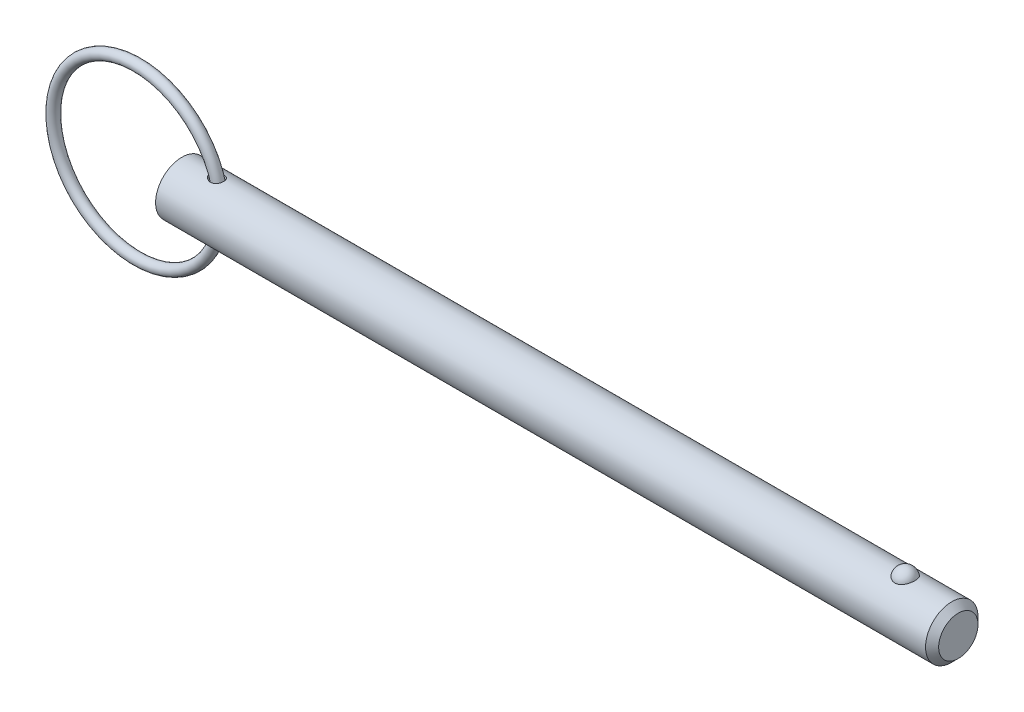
ISO-10303-21;
HEADER;
FILE_DESCRIPTION(('STEP AP214'),'2;1');
FILE_NAME('part.step','',(''),(''),'','','');
FILE_SCHEMA(('AUTOMOTIVE_DESIGN { 1 0 10303 214 1 1 1 1 }'));
ENDSEC;
DATA;
#1=APPLICATION_CONTEXT('core data for automotive mechanical design processes');
#2=APPLICATION_PROTOCOL_DEFINITION('international standard','automotive_design',2000,#1);
#3=PRODUCT_CONTEXT('',#1,'mechanical');
#4=PRODUCT('Part','Part','',(#3));
#5=PRODUCT_RELATED_PRODUCT_CATEGORY('part','',(#4));
#6=PRODUCT_DEFINITION_FORMATION('','',#4);
#7=PRODUCT_DEFINITION_CONTEXT('part definition',#1,'design');
#8=PRODUCT_DEFINITION('design','',#6,#7);
#9=PRODUCT_DEFINITION_SHAPE('','',#8);
#10=(LENGTH_UNIT() NAMED_UNIT(*) SI_UNIT(.MILLI.,.METRE.));
#11=(NAMED_UNIT(*) PLANE_ANGLE_UNIT() SI_UNIT($,.RADIAN.));
#12=(NAMED_UNIT(*) SI_UNIT($,.STERADIAN.) SOLID_ANGLE_UNIT());
#13=UNCERTAINTY_MEASURE_WITH_UNIT(LENGTH_MEASURE(1.E-05),#10,'distance_accuracy_value','');
#14=(GEOMETRIC_REPRESENTATION_CONTEXT(3) GLOBAL_UNCERTAINTY_ASSIGNED_CONTEXT((#13)) GLOBAL_UNIT_ASSIGNED_CONTEXT((#10,
#11,#12)) REPRESENTATION_CONTEXT('',''));
#15=CARTESIAN_POINT('',(0.,0.,0.));
#16=DIRECTION('',(0.,0.,1.));
#17=DIRECTION('',(1.,0.,0.));
#18=AXIS2_PLACEMENT_3D('',#15,#16,#17);
#19=CARTESIAN_POINT('',(-6.75433730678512,0.,0.));
#20=DIRECTION('',(0.,0.,1.));
#21=DIRECTION('',(1.,0.,0.));
#22=AXIS2_PLACEMENT_3D('',#19,#20,#21);
#23=TOROIDAL_SURFACE('',#22,12.7,0.794);
#24=CARTESIAN_POINT('',(6.73966269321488,0.,0.));
#25=VERTEX_POINT('',#24);
#26=VERTEX_LOOP('',#25);
#27=FACE_BOUND('',#26,.T.);
#28=ADVANCED_FACE('P0_F12',(#27),#23,.T.);
#29=CLOSED_SHELL('',(#28));
#30=MANIFOLD_SOLID_BREP('P0_B1',#29);
#31=CARTESIAN_POINT('',(0.,0.,0.));
#32=DIRECTION('',(1.,0.,0.));
#33=DIRECTION('',(0.,0.,-1.));
#34=AXIS2_PLACEMENT_3D('',#31,#32,#33);
#35=CYLINDRICAL_SURFACE('',#34,3.97);
#36=CARTESIAN_POINT('',(4.47423598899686,3.9272127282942,-0.581291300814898));
#37=CARTESIAN_POINT('',(4.51402362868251,3.92000695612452,-0.62997219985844));
#38=CARTESIAN_POINT('',(4.55825642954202,3.91241085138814,-0.675032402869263));
#39=CARTESIAN_POINT('',(4.65378532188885,3.8973704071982,-0.757069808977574));
#40=CARTESIAN_POINT('',(4.70509780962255,3.88992646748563,-0.794027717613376));
#41=CARTESIAN_POINT('',(4.81300878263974,3.87608600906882,-0.859045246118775));
#42=CARTESIAN_POINT('',(4.86959180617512,3.86968656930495,-0.887129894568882));
#43=CARTESIAN_POINT('',(4.98666757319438,3.85867771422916,-0.933854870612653));
#44=CARTESIAN_POINT('',(5.04715829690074,3.85406738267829,-0.952500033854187));
#45=CARTESIAN_POINT('',(5.17222686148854,3.84716625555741,-0.980011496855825));
#46=CARTESIAN_POINT('',(5.23687124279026,3.84494236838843,-0.988596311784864));
#47=CARTESIAN_POINT('',(5.36671178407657,3.84347581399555,-0.994286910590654));
#48=CARTESIAN_POINT('',(5.43190770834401,3.84423193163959,-0.991397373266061));
#49=CARTESIAN_POINT('',(5.5560514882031,3.84859691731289,-0.974304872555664));
#50=CARTESIAN_POINT('',(5.61511712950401,3.85200226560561,-0.960908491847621));
#51=CARTESIAN_POINT('',(5.72974412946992,3.8610605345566,-0.923836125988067));
#52=CARTESIAN_POINT('',(5.78530708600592,3.86671242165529,-0.90016486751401));
#53=CARTESIAN_POINT('',(5.88712740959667,3.87908259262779,-0.845190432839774));
#54=CARTESIAN_POINT('',(5.93376792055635,3.88569301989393,-0.814569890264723));
#55=CARTESIAN_POINT('',(6.02101503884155,3.89947732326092,-0.745789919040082));
#56=CARTESIAN_POINT('',(6.06162229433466,3.90665113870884,-0.707631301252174));
#57=CARTESIAN_POINT('',(6.13496290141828,3.9206013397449,-0.625680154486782));
#58=CARTESIAN_POINT('',(6.16783367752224,3.92738273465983,-0.582011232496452));
#59=CARTESIAN_POINT('',(6.2258925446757,3.93995609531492,-0.489706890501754));
#60=CARTESIAN_POINT('',(6.25108046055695,3.94574803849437,-0.441071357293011));
#61=CARTESIAN_POINT('',(6.29336449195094,3.95576358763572,-0.339770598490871));
#62=CARTESIAN_POINT('',(6.31039150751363,3.95997373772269,-0.28707520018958));
#63=CARTESIAN_POINT('',(6.33565624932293,3.96630600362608,-0.179496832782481));
#64=CARTESIAN_POINT('',(6.34389366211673,3.96842804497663,-0.124613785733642));
#65=CARTESIAN_POINT('',(6.35142037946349,3.97036465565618,-0.0138440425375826));
#66=CARTESIAN_POINT('',(6.35065227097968,3.97016441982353,0.0420468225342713));
#67=CARTESIAN_POINT('',(6.34004566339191,3.96744188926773,0.152904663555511));
#68=CARTESIAN_POINT('',(6.33020697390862,3.96491954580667,0.207871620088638));
#69=CARTESIAN_POINT('',(6.30166659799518,3.95782104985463,0.315369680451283));
#70=CARTESIAN_POINT('',(6.28295698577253,3.95324306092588,0.36789855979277));
#71=CARTESIAN_POINT('',(6.23710200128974,3.94253162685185,0.468965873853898));
#72=CARTESIAN_POINT('',(6.20995670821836,3.93639819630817,0.517504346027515));
#73=CARTESIAN_POINT('',(6.14798638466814,3.92327702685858,0.609041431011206));
#74=CARTESIAN_POINT('',(6.11318666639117,3.91629213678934,0.652057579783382));
#75=CARTESIAN_POINT('',(6.03675089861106,3.90223639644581,0.731492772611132));
#76=CARTESIAN_POINT('',(5.99511563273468,3.89516555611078,0.767912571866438));
#77=CARTESIAN_POINT('',(5.90657479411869,3.88180215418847,0.832828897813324));
#78=CARTESIAN_POINT('',(5.85972260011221,3.87550288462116,0.86139687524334));
#79=CARTESIAN_POINT('',(5.76177854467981,3.86429747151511,0.910350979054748));
#80=CARTESIAN_POINT('',(5.71068697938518,3.8593912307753,0.930737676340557));
#81=CARTESIAN_POINT('',(5.60571987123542,3.85147434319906,0.962976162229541));
#82=CARTESIAN_POINT('',(5.55184284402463,3.84846471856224,0.974823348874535));
#83=CARTESIAN_POINT('',(5.44283210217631,3.84460058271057,0.989953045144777));
#84=CARTESIAN_POINT('',(5.38769814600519,3.84374648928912,0.99323389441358));
#85=CARTESIAN_POINT('',(5.27524330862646,3.84420584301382,0.991454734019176));
#86=CARTESIAN_POINT('',(5.21792896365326,3.84561285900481,0.986034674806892));
#87=CARTESIAN_POINT('',(5.1048579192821,3.85052758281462,0.966661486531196));
#88=CARTESIAN_POINT('',(5.04910180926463,3.85403607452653,0.952705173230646));
#89=CARTESIAN_POINT('',(4.93593174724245,3.86308835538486,0.915340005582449));
#90=CARTESIAN_POINT('',(4.8787523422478,3.86877458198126,0.891254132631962));
#91=CARTESIAN_POINT('',(4.7690169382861,3.88143650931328,0.83438431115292));
#92=CARTESIAN_POINT('',(4.71646372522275,3.88841297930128,0.801595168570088));
#93=CARTESIAN_POINT('',(4.61492504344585,3.90324173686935,0.726056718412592));
#94=CARTESIAN_POINT('',(4.56625259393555,3.91112043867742,0.682888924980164));
#95=CARTESIAN_POINT('',(4.47749220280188,3.92644930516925,0.588370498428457));
#96=CARTESIAN_POINT('',(4.43740132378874,3.93389961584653,0.537022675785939));
#97=CARTESIAN_POINT('',(4.37035516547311,3.94686586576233,0.431042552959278));
#98=CARTESIAN_POINT('',(4.34268823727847,3.95247934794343,0.376876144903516));
#99=CARTESIAN_POINT('',(4.29855851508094,3.96161331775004,0.264011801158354));
#100=CARTESIAN_POINT('',(4.28207681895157,3.96513733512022,0.20532169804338));
#101=CARTESIAN_POINT('',(4.26319409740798,3.96919493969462,0.094762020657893));
#102=CARTESIAN_POINT('',(4.25904206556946,3.97009986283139,0.0432014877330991));
#103=CARTESIAN_POINT('',(4.26004223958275,3.9698827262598,-0.0598293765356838));
#104=CARTESIAN_POINT('',(4.26519288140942,3.96876100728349,-0.111299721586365));
#105=CARTESIAN_POINT('',(4.28369027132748,3.96479623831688,-0.208517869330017));
#106=CARTESIAN_POINT('',(4.29637416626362,3.96209263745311,-0.25440084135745));
#107=CARTESIAN_POINT('',(4.32867922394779,3.95536287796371,-0.343510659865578));
#108=CARTESIAN_POINT('',(4.34829584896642,3.95133758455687,-0.386739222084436));
#109=CARTESIAN_POINT('',(4.38573190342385,3.94389838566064,-0.455314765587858));
#110=CARTESIAN_POINT('',(4.40181371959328,3.94075686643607,-0.481662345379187));
#111=CARTESIAN_POINT('',(4.43632024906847,3.93417901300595,-0.532726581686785));
#112=CARTESIAN_POINT('',(4.45474473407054,3.93074270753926,-0.557443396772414));
#113=CARTESIAN_POINT('',(4.47423598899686,3.9272127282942,-0.581291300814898));
#114=B_SPLINE_CURVE_WITH_KNOTS('',3,(#36,#37,#38,#39,#40,#41,#42,#43,#44,#45,#46,#47,#48,#49,
#50,#51,#52,#53,#54,#55,#56,#57,#58,#59,#60,#61,#62,#63,#64,#65,#66,#67,#68,#69,#70,#71,#72,#73,
#74,#75,#76,#77,#78,#79,#80,#81,#82,#83,#84,#85,#86,#87,#88,#89,#90,#91,#92,#93,#94,#95,#96,#97,
#98,#99,#100,#101,#102,#103,#104,#105,#106,#107,#108,#109,#110,#111,#112,#113),.UNSPECIFIED.,
.T.,.F.,(4,2,2,2,2,2,2,2,2,2,2,2,2,2,2,2,2,2,2,2,2,2,2,2,2,2,2,2,2,2,2,2,2,2,2,2,2,2,4),(0.,
0.189730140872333,0.379907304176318,0.569543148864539,0.759081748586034,0.953805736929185,
1.148450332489,1.32946176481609,1.51039001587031,1.67812095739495,1.84583386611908,
2.01029437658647,2.17475863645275,2.34059186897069,2.50643101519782,2.67332801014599,
2.84022850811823,3.00727840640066,3.17432673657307,3.34083074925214,3.50731568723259,
3.67223129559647,3.83713539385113,4.00212829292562,4.16715316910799,4.33918465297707,
4.5112803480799,4.69738596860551,4.88360290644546,5.07919911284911,5.27472826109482,
5.45686425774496,5.63869168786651,5.79305070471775,5.94738377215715,6.08981233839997,
6.2321478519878,6.3251023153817,6.4180477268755),.UNSPECIFIED.);
#115=CARTESIAN_POINT('',(4.47423598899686,3.9272127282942,-0.581291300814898));
#116=VERTEX_POINT('',#115);
#117=EDGE_CURVE('P1_E40',#116,#116,#114,.T.);
#118=ORIENTED_EDGE('',*,*,#117,.T.);
#119=EDGE_LOOP('',(#118));
#120=FACE_BOUND('',#119,.T.);
#121=CARTESIAN_POINT('',(116.4875,0.,0.));
#122=DIRECTION('',(1.,0.,0.));
#123=DIRECTION('',(0.,0.,-1.));
#124=AXIS2_PLACEMENT_3D('',#121,#122,#123);
#125=CIRCLE('',#124,3.97);
#126=CARTESIAN_POINT('',(116.4875,0.,-3.97));
#127=VERTEX_POINT('',#126);
#128=EDGE_CURVE('P1_E25',#127,#127,#125,.T.);
#129=ORIENTED_EDGE('',*,*,#128,.F.);
#130=EDGE_LOOP('',(#129));
#131=FACE_BOUND('',#130,.T.);
#132=CARTESIAN_POINT('',(0.,0.,0.));
#133=DIRECTION('',(1.,0.,0.));
#134=DIRECTION('',(0.,0.,-1.));
#135=AXIS2_PLACEMENT_3D('',#132,#133,#134);
#136=CIRCLE('',#135,3.97);
#137=CARTESIAN_POINT('',(0.,0.,-3.97));
#138=VERTEX_POINT('',#137);
#139=EDGE_CURVE('P1_E9',#138,#138,#136,.T.);
#140=ORIENTED_EDGE('',*,*,#139,.T.);
#141=EDGE_LOOP('',(#140));
#142=FACE_BOUND('',#141,.T.);
#143=CARTESIAN_POINT('',(109.445192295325,3.65715365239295,1.5447094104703));
#144=CARTESIAN_POINT('',(109.365244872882,3.65716001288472,1.54470290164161));
#145=CARTESIAN_POINT('',(109.285165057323,3.65987074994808,1.53832549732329));
#146=CARTESIAN_POINT('',(109.127237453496,3.6704221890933,1.51297018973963));
#147=CARTESIAN_POINT('',(109.04939614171,3.67827646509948,1.49395894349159));
#148=CARTESIAN_POINT('',(108.898461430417,3.69818848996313,1.4439595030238));
#149=CARTESIAN_POINT('',(108.825356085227,3.71023513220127,1.41300293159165));
#150=CARTESIAN_POINT('',(108.685563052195,3.7372183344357,1.34000212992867));
#151=CARTESIAN_POINT('',(108.618872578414,3.75215363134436,1.29796274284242));
#152=CARTESIAN_POINT('',(108.49148864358,3.78384968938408,1.20248834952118));
#153=CARTESIAN_POINT('',(108.431029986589,3.80065129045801,1.14875388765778));
#154=CARTESIAN_POINT('',(108.319694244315,3.83398532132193,1.03205417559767));
#155=CARTESIAN_POINT('',(108.268820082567,3.85051766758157,0.969086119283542));
#156=CARTESIAN_POINT('',(108.175632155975,3.88238608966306,0.832526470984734));
#157=CARTESIAN_POINT('',(108.133796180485,3.89763698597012,0.758588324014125));
#158=CARTESIAN_POINT('',(108.062510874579,3.92451063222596,0.604352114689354));
#159=CARTESIAN_POINT('',(108.033062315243,3.93613315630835,0.52405365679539));
#160=CARTESIAN_POINT('',(107.986892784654,3.95467606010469,0.358403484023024));
#161=CARTESIAN_POINT('',(107.970312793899,3.96154426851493,0.273006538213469));
#162=CARTESIAN_POINT('',(107.950756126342,3.96967008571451,0.100408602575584));
#163=CARTESIAN_POINT('',(107.947778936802,3.97092790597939,0.013207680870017));
#164=CARTESIAN_POINT('',(107.955458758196,3.96771794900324,-0.159844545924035));
#165=CARTESIAN_POINT('',(107.966016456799,3.96329187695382,-0.245701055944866));
#166=CARTESIAN_POINT('',(108.00038009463,3.94923163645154,-0.41427746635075));
#167=CARTESIAN_POINT('',(108.024186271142,3.93959737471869,-0.496997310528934));
#168=CARTESIAN_POINT('',(108.08461142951,3.91607752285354,-0.657113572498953));
#169=CARTESIAN_POINT('',(108.121249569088,3.90218558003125,-0.734501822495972));
#170=CARTESIAN_POINT('',(108.206593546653,3.87158287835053,-0.881704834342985));
#171=CARTESIAN_POINT('',(108.255300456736,3.8548718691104,-0.951518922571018));
#172=CARTESIAN_POINT('',(108.364116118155,3.82028735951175,-1.08208159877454));
#173=CARTESIAN_POINT('',(108.424295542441,3.80240713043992,-1.14276958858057));
#174=CARTESIAN_POINT('',(108.554493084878,3.76758161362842,-1.2528243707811));
#175=CARTESIAN_POINT('',(108.624510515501,3.75063626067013,-1.30219195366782));
#176=CARTESIAN_POINT('',(108.77118160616,3.71998948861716,-1.38729709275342));
#177=CARTESIAN_POINT('',(108.847681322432,3.70623183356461,-1.42327904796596));
#178=CARTESIAN_POINT('',(109.006298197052,3.68323188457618,-1.48178996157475));
#179=CARTESIAN_POINT('',(109.0884132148,3.67398788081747,-1.50432401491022));
#180=CARTESIAN_POINT('',(109.251481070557,3.6615216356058,-1.53440939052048));
#181=CARTESIAN_POINT('',(109.332284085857,3.65801951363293,-1.54265826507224));
#182=CARTESIAN_POINT('',(109.49420850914,3.65657341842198,-1.54608423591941));
#183=CARTESIAN_POINT('',(109.575329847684,3.65862829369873,-1.5412640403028));
#184=CARTESIAN_POINT('',(109.732812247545,3.66788969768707,-1.51908474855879));
#185=CARTESIAN_POINT('',(109.809242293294,3.67492621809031,-1.50213925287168));
#186=CARTESIAN_POINT('',(109.958041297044,3.69318404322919,-1.4566698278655));
#187=CARTESIAN_POINT('',(110.030409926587,3.7044056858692,-1.42814496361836));
#188=CARTESIAN_POINT('',(110.170802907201,3.73012749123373,-1.35956319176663));
#189=CARTESIAN_POINT('',(110.238700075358,3.74469307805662,-1.31927107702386));
#190=CARTESIAN_POINT('',(110.366864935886,3.77545272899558,-1.22847440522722));
#191=CARTESIAN_POINT('',(110.427130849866,3.79164717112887,-1.17796747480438));
#192=CARTESIAN_POINT('',(110.541634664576,3.82490325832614,-1.06519260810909));
#193=CARTESIAN_POINT('',(110.595413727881,3.84196735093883,-1.00245914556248));
#194=CARTESIAN_POINT('',(110.692098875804,3.87439863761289,-0.86871586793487));
#195=CARTESIAN_POINT('',(110.735003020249,3.88976552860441,-0.79770457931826));
#196=CARTESIAN_POINT('',(110.810266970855,3.91771381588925,-0.646896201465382));
#197=CARTESIAN_POINT('',(110.84225322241,3.93019255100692,-0.566893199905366));
#198=CARTESIAN_POINT('',(110.893110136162,3.95043886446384,-0.402255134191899));
#199=CARTESIAN_POINT('',(110.911980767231,3.95820643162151,-0.31762005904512));
#200=CARTESIAN_POINT('',(110.93621625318,3.96823733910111,-0.146156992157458));
#201=CARTESIAN_POINT('',(110.941587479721,3.970503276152,-0.0593300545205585));
#202=CARTESIAN_POINT('',(110.938730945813,3.96930811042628,0.114057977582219));
#203=CARTESIAN_POINT('',(110.930503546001,3.9658471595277,0.200619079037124));
#204=CARTESIAN_POINT('',(110.900706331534,3.95358562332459,0.370506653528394));
#205=CARTESIAN_POINT('',(110.87921294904,3.94481563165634,0.453848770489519));
#206=CARTESIAN_POINT('',(110.82338397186,3.92284586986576,0.615497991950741));
#207=CARTESIAN_POINT('',(110.789047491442,3.90964579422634,0.69380474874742));
#208=CARTESIAN_POINT('',(110.707970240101,3.88006987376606,0.843703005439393));
#209=CARTESIAN_POINT('',(110.661153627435,3.86367478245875,0.915249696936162));
#210=CARTESIAN_POINT('',(110.556189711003,3.82949741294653,1.04910810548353));
#211=CARTESIAN_POINT('',(110.498042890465,3.81171519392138,1.1114202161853));
#212=CARTESIAN_POINT('',(110.371743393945,3.77673366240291,1.22503948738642));
#213=CARTESIAN_POINT('',(110.303597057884,3.75953398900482,1.27635357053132));
#214=CARTESIAN_POINT('',(110.158900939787,3.72770506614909,1.36653336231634));
#215=CARTESIAN_POINT('',(110.082348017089,3.7130767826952,1.4053943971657));
#216=CARTESIAN_POINT('',(109.925759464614,3.68864287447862,1.46830480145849));
#217=CARTESIAN_POINT('',(109.845930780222,3.67869017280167,1.49281289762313));
#218=CARTESIAN_POINT('',(109.682987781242,3.66414535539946,1.52817474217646));
#219=CARTESIAN_POINT('',(109.599884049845,3.65953723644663,1.53906926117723));
#220=CARTESIAN_POINT('',(109.492776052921,3.6573894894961,1.54414878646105));
#221=CARTESIAN_POINT('',(109.468990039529,3.65715175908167,1.54471134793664));
#222=CARTESIAN_POINT('',(109.445192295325,3.65715365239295,1.5447094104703));
#223=B_SPLINE_CURVE_WITH_KNOTS('',3,(#143,#144,#145,#146,#147,#148,#149,#150,#151,#152,#153,
#154,#155,#156,#157,#158,#159,#160,#161,#162,#163,#164,#165,#166,#167,#168,#169,#170,#171,#172,
#173,#174,#175,#176,#177,#178,#179,#180,#181,#182,#183,#184,#185,#186,#187,#188,#189,#190,#191,
#192,#193,#194,#195,#196,#197,#198,#199,#200,#201,#202,#203,#204,#205,#206,#207,#208,#209,#210,
#211,#212,#213,#214,#215,#216,#217,#218,#219,#220,#221,#222),.UNSPECIFIED.,.T.,.F.,(4,2,2,2,2,2,
2,2,2,2,2,2,2,2,2,2,2,2,2,2,2,2,2,2,2,2,2,2,2,2,2,2,2,2,2,2,2,2,2,4),(0.,0.239777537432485,
0.480190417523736,0.719971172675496,0.9596473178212,1.20639040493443,1.45320863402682,
1.71093679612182,1.9686809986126,2.22921052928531,2.48973023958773,2.74834928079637,
3.00697295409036,3.26598440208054,3.52501886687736,3.78570385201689,4.04637062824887,
4.30201257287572,4.55755760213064,4.80022994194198,5.04285200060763,5.27757006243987,
5.51230707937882,5.7521012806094,5.99195126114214,6.24392810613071,6.49594987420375,
6.75588818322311,7.01582710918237,7.27564332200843,7.5354526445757,7.79377886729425,
8.05212290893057,8.31207418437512,8.57201437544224,8.83179046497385,9.09166393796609,
9.34270057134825,9.59298357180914,9.66435753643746),.UNSPECIFIED.);
#224=CARTESIAN_POINT('',(109.445192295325,3.65715365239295,1.5447094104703));
#225=VERTEX_POINT('',#224);
#226=EDGE_CURVE('P1_E34',#225,#225,#223,.T.);
#227=ORIENTED_EDGE('',*,*,#226,.T.);
#228=EDGE_LOOP('',(#227));
#229=FACE_BOUND('',#228,.T.);
#230=CARTESIAN_POINT('',(4.47423598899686,-3.9272127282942,-0.581291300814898));
#231=CARTESIAN_POINT('',(4.44128910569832,-3.93317954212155,-0.540978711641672));
#232=CARTESIAN_POINT('',(4.41136828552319,-3.93888228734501,-0.498159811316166));
#233=CARTESIAN_POINT('',(4.35872676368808,-3.94921939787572,-0.408179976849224));
#234=CARTESIAN_POINT('',(4.33600082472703,-3.95385453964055,-0.36102223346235));
#235=CARTESIAN_POINT('',(4.29878526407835,-3.9615772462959,-0.263108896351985));
#236=CARTESIAN_POINT('',(4.28434166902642,-3.96465615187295,-0.212334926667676));
#237=CARTESIAN_POINT('',(4.26481927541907,-3.96884157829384,-0.108934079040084));
#238=CARTESIAN_POINT('',(4.25973608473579,-3.96994902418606,-0.0563080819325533));
#239=CARTESIAN_POINT('',(4.25930094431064,-3.97004379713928,0.0449240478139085));
#240=CARTESIAN_POINT('',(4.26323134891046,-3.96918747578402,0.0935283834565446));
#241=CARTESIAN_POINT('',(4.27911923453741,-3.96577236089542,0.189336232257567));
#242=CARTESIAN_POINT('',(4.29107713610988,-3.96321347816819,0.236539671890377));
#243=CARTESIAN_POINT('',(4.3222019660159,-3.95670052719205,0.327873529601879));
#244=CARTESIAN_POINT('',(4.34129939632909,-3.95275993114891,0.37202886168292));
#245=CARTESIAN_POINT('',(4.38584298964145,-3.94385347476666,0.456884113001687));
#246=CARTESIAN_POINT('',(4.41129114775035,-3.93888729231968,0.497582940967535));
#247=CARTESIAN_POINT('',(4.47067915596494,-3.92777410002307,0.57910486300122));
#248=CARTESIAN_POINT('',(4.50523982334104,-3.92155746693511,0.61946509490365));
#249=CARTESIAN_POINT('',(4.57989786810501,-3.90894004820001,0.694653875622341));
#250=CARTESIAN_POINT('',(4.61999845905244,-3.90253915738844,0.729479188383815));
#251=CARTESIAN_POINT('',(4.7106931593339,-3.88921622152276,0.79766500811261));
#252=CARTESIAN_POINT('',(4.76196990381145,-3.88234748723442,0.830130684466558));
#253=CARTESIAN_POINT('',(4.86907659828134,-3.86980743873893,0.886754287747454));
#254=CARTESIAN_POINT('',(4.92490895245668,-3.86413676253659,0.91090779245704));
#255=CARTESIAN_POINT('',(5.04387274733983,-3.85430959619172,0.951667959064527));
#256=CARTESIAN_POINT('',(5.10724127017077,-3.85028805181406,0.967622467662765));
#257=CARTESIAN_POINT('',(5.23589558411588,-3.84499084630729,0.988466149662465));
#258=CARTESIAN_POINT('',(5.30118075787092,-3.84371431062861,0.993358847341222));
#259=CARTESIAN_POINT('',(5.42870419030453,-3.84421020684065,0.991437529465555));
#260=CARTESIAN_POINT('',(5.49094970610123,-3.84585050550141,0.985130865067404));
#261=CARTESIAN_POINT('',(5.61317445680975,-3.85182888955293,0.961489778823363));
#262=CARTESIAN_POINT('',(5.67315499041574,-3.85616540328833,0.944161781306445));
#263=CARTESIAN_POINT('',(5.78385047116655,-3.86655540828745,0.900611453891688));
#264=CARTESIAN_POINT('',(5.83492113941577,-3.87243611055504,0.875248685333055));
#265=CARTESIAN_POINT('',(5.93173444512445,-3.88533932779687,0.816058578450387));
#266=CARTESIAN_POINT('',(5.97747806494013,-3.89236163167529,0.78223280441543));
#267=CARTESIAN_POINT('',(6.06067538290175,-3.90644082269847,0.708499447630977));
#268=CARTESIAN_POINT('',(6.09837515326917,-3.9134865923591,0.668866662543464));
#269=CARTESIAN_POINT('',(6.16659675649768,-3.92708124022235,0.583768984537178));
#270=CARTESIAN_POINT('',(6.19711866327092,-3.93363012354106,0.538304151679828));
#271=CARTESIAN_POINT('',(6.25033980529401,-3.94554016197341,0.44265233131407));
#272=CARTESIAN_POINT('',(6.27301093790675,-3.95089702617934,0.392449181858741));
#273=CARTESIAN_POINT('',(6.3098605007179,-3.95981777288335,0.288866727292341));
#274=CARTESIAN_POINT('',(6.32403857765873,-3.96338158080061,0.235487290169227));
#275=CARTESIAN_POINT('',(6.34366897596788,-3.96835894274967,0.126579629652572));
#276=CARTESIAN_POINT('',(6.34904619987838,-3.9697539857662,0.0710370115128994));
#277=CARTESIAN_POINT('',(6.35072157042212,-3.97018611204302,-0.0401947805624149));
#278=CARTESIAN_POINT('',(6.34701950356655,-3.96922313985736,-0.0958839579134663));
#279=CARTESIAN_POINT('',(6.33059893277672,-3.96503727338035,-0.205963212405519));
#280=CARTESIAN_POINT('',(6.31785949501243,-3.96180913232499,-0.260349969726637));
#281=CARTESIAN_POINT('',(6.28362857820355,-3.95343617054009,-0.366141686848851));
#282=CARTESIAN_POINT('',(6.26213701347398,-3.94829133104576,-0.417546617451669));
#283=CARTESIAN_POINT('',(6.21094198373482,-3.93665740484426,-0.515825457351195));
#284=CARTESIAN_POINT('',(6.18125109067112,-3.93017037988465,-0.562706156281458));
#285=CARTESIAN_POINT('',(6.11437296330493,-3.91656890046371,-0.650670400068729));
#286=CARTESIAN_POINT('',(6.07718632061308,-3.90945449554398,-0.691754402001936));
#287=CARTESIAN_POINT('',(5.99660825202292,-3.89545704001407,-0.76665430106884));
#288=CARTESIAN_POINT('',(5.95326700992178,-3.88857262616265,-0.800523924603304));
#289=CARTESIAN_POINT('',(5.86137696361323,-3.87574946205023,-0.860470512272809));
#290=CARTESIAN_POINT('',(5.81282877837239,-3.86981059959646,-0.886548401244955));
#291=CARTESIAN_POINT('',(5.71225875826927,-3.85955823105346,-0.93016771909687));
#292=CARTESIAN_POINT('',(5.6602610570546,-3.85523459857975,-0.947762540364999));
#293=CARTESIAN_POINT('',(5.55400860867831,-3.84858369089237,-0.974419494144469));
#294=CARTESIAN_POINT('',(5.49975362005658,-3.84625662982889,-0.983480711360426));
#295=CARTESIAN_POINT('',(5.38905619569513,-3.84373902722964,-0.99327593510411));
#296=CARTESIAN_POINT('',(5.33259335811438,-3.8436048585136,-0.993790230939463));
#297=CARTESIAN_POINT('',(5.22028568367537,-3.84553679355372,-0.986285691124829));
#298=CARTESIAN_POINT('',(5.16444101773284,-3.84760349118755,-0.978264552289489));
#299=CARTESIAN_POINT('',(5.05063804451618,-3.85386728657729,-0.953301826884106));
#300=CARTESIAN_POINT('',(4.99282059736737,-3.85820814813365,-0.935754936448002));
#301=CARTESIAN_POINT('',(4.88067115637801,-3.86855108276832,-0.89202836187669));
#302=CARTESIAN_POINT('',(4.82634209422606,-3.87455453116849,-0.865841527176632));
#303=CARTESIAN_POINT('',(4.71735796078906,-3.8882057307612,-0.802439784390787));
#304=CARTESIAN_POINT('',(4.66319676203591,-3.89595714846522,-0.764393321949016));
#305=CARTESIAN_POINT('',(4.5624904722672,-3.9116844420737,-0.679328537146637));
#306=CARTESIAN_POINT('',(4.51593909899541,-3.9196601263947,-0.632317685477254));
#307=CARTESIAN_POINT('',(4.47423598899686,-3.9272127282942,-0.581291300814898));
#308=B_SPLINE_CURVE_WITH_KNOTS('',3,(#230,#231,#232,#233,#234,#235,#236,#237,#238,#239,#240,
#241,#242,#243,#244,#245,#246,#247,#248,#249,#250,#251,#252,#253,#254,#255,#256,#257,#258,#259,
#260,#261,#262,#263,#264,#265,#266,#267,#268,#269,#270,#271,#272,#273,#274,#275,#276,#277,#278,
#279,#280,#281,#282,#283,#284,#285,#286,#287,#288,#289,#290,#291,#292,#293,#294,#295,#296,#297,
#298,#299,#300,#301,#302,#303,#304,#305,#306,#307),.UNSPECIFIED.,.T.,.F.,(4,2,2,2,2,2,2,2,2,2,2,
2,2,2,2,2,2,2,2,2,2,2,2,2,2,2,2,2,2,2,2,2,2,2,2,2,2,2,4),(0.,0.157032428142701,
0.313950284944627,0.47173191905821,0.629439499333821,0.775030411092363,0.920628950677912,
1.06484561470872,1.20910764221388,1.36897610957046,1.5289377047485,1.71139614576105,
1.89395150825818,2.08937788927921,2.28474199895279,2.4714801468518,2.65810954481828,
2.82921764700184,3.00029414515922,3.16497190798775,3.32964797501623,3.49490756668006,
3.66017403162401,3.82684349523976,3.99351687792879,4.16057760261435,4.3276399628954,
4.49444757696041,4.66124203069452,4.82674719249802,4.99223270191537,5.15666259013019,
5.32111011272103,5.48977863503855,5.6584926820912,5.83945443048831,6.02056632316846,
6.21949800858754,6.41826462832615),.UNSPECIFIED.);
#309=CARTESIAN_POINT('',(4.47423598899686,-3.9272127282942,-0.581291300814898));
#310=VERTEX_POINT('',#309);
#311=EDGE_CURVE('P1_E17',#310,#310,#308,.T.);
#312=ORIENTED_EDGE('',*,*,#311,.T.);
#313=EDGE_LOOP('',(#312));
#314=FACE_BOUND('',#313,.T.);
#315=ADVANCED_FACE('P1_F13',(#120,#131,#142,#229,#314),#35,.T.);
#316=CARTESIAN_POINT('',(0.,0.,0.));
#317=DIRECTION('',(-1.,0.,0.));
#318=DIRECTION('',(0.,0.,1.));
#319=AXIS2_PLACEMENT_3D('',#316,#317,#318);
#320=PLANE('',#319);
#321=ORIENTED_EDGE('',*,*,#139,.F.);
#322=EDGE_LOOP('',(#321));
#323=FACE_BOUND('',#322,.T.);
#324=ADVANCED_FACE('P1_F15',(#323),#320,.T.);
#325=CARTESIAN_POINT('',(117.48,0.,0.));
#326=DIRECTION('',(-1.,0.,0.));
#327=DIRECTION('',(0.,0.,1.));
#328=AXIS2_PLACEMENT_3D('',#325,#326,#327);
#329=CONICAL_SURFACE('',#328,2.97750000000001,0.785398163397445);
#330=ORIENTED_EDGE('',*,*,#128,.T.);
#331=EDGE_LOOP('',(#330));
#332=FACE_BOUND('',#331,.T.);
#333=CARTESIAN_POINT('',(117.48,0.,0.));
#334=DIRECTION('',(1.,0.,0.));
#335=DIRECTION('',(0.,0.,-1.));
#336=AXIS2_PLACEMENT_3D('',#333,#334,#335);
#337=CIRCLE('',#336,2.97750000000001);
#338=CARTESIAN_POINT('',(117.48,0.,-2.97750000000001));
#339=VERTEX_POINT('',#338);
#340=EDGE_CURVE('P1_E30',#339,#339,#337,.T.);
#341=ORIENTED_EDGE('',*,*,#340,.F.);
#342=EDGE_LOOP('',(#341));
#343=FACE_BOUND('',#342,.T.);
#344=ADVANCED_FACE('P1_F55',(#332,#343),#329,.T.);
#345=CARTESIAN_POINT('',(117.48,2.97750000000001,0.));
#346=DIRECTION('',(1.,0.,0.));
#347=DIRECTION('',(0.,0.,-1.));
#348=AXIS2_PLACEMENT_3D('',#345,#346,#347);
#349=PLANE('',#348);
#350=ORIENTED_EDGE('',*,*,#340,.T.);
#351=EDGE_LOOP('',(#350));
#352=FACE_BOUND('',#351,.T.);
#353=ADVANCED_FACE('P1_F51',(#352),#349,.T.);
#354=CARTESIAN_POINT('',(109.445192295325,3.573,0.));
#355=DIRECTION('',(-1.,0.,0.));
#356=DIRECTION('',(0.,1.,0.));
#357=AXIS2_PLACEMENT_3D('',#354,#355,#356);
#358=SPHERICAL_SURFACE('',#357,1.54700000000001);
#359=ORIENTED_EDGE('',*,*,#226,.F.);
#360=EDGE_LOOP('',(#359));
#361=FACE_BOUND('',#360,.T.);
#362=ADVANCED_FACE('P1_F46',(#361),#358,.T.);
#363=CARTESIAN_POINT('',(-6.75433730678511,0.,0.));
#364=DIRECTION('',(0.,0.,1.));
#365=DIRECTION('',(1.,0.,0.));
#366=AXIS2_PLACEMENT_3D('',#363,#364,#365);
#367=TOROIDAL_SURFACE('',#366,12.7,0.9925);
#368=ORIENTED_EDGE('',*,*,#311,.F.);
#369=EDGE_LOOP('',(#368));
#370=FACE_BOUND('',#369,.T.);
#371=ORIENTED_EDGE('',*,*,#117,.F.);
#372=EDGE_LOOP('',(#371));
#373=FACE_BOUND('',#372,.T.);
#374=ADVANCED_FACE('P1_F50',(#370,#373),#367,.F.);
#375=CLOSED_SHELL('',(#315,#324,#344,#353,#362,#374));
#376=MANIFOLD_SOLID_BREP('P1_B1',#375);
#377=ADVANCED_BREP_SHAPE_REPRESENTATION('',(#18,#30,#376),#14);
#378=SHAPE_DEFINITION_REPRESENTATION(#9,#377);
ENDSEC;
END-ISO-10303-21;
